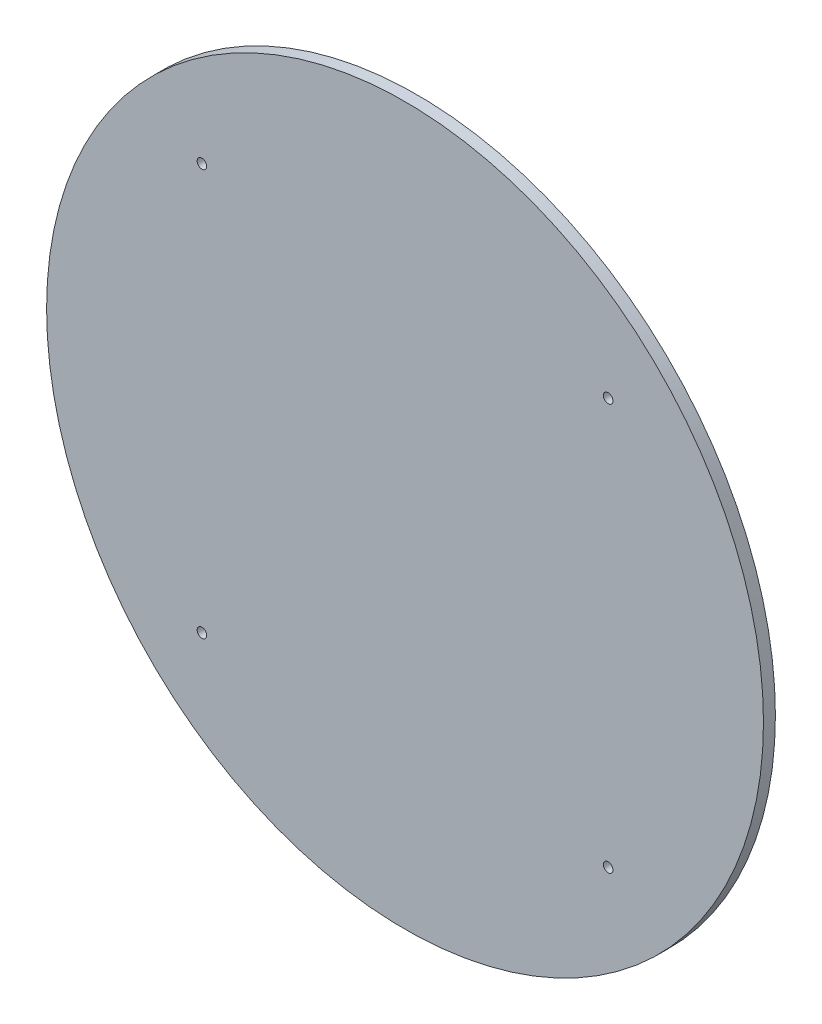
ISO-10303-21;
HEADER;
FILE_DESCRIPTION(('STEP AP214'),'2;1');
FILE_NAME('part.step','',(''),(''),'','','');
FILE_SCHEMA(('AUTOMOTIVE_DESIGN { 1 0 10303 214 1 1 1 1 }'));
ENDSEC;
DATA;
#1=APPLICATION_CONTEXT('core data for automotive mechanical design processes');
#2=APPLICATION_PROTOCOL_DEFINITION('international standard','automotive_design',2000,#1);
#3=PRODUCT_CONTEXT('',#1,'mechanical');
#4=PRODUCT('Part','Part','',(#3));
#5=PRODUCT_RELATED_PRODUCT_CATEGORY('part','',(#4));
#6=PRODUCT_DEFINITION_FORMATION('','',#4);
#7=PRODUCT_DEFINITION_CONTEXT('part definition',#1,'design');
#8=PRODUCT_DEFINITION('design','',#6,#7);
#9=PRODUCT_DEFINITION_SHAPE('','',#8);
#10=(LENGTH_UNIT() NAMED_UNIT(*) SI_UNIT(.MILLI.,.METRE.));
#11=(NAMED_UNIT(*) PLANE_ANGLE_UNIT() SI_UNIT($,.RADIAN.));
#12=(NAMED_UNIT(*) SI_UNIT($,.STERADIAN.) SOLID_ANGLE_UNIT());
#13=UNCERTAINTY_MEASURE_WITH_UNIT(LENGTH_MEASURE(1.E-05),#10,'distance_accuracy_value','');
#14=(GEOMETRIC_REPRESENTATION_CONTEXT(3) GLOBAL_UNCERTAINTY_ASSIGNED_CONTEXT((#13)) GLOBAL_UNIT_ASSIGNED_CONTEXT((#10,
#11,#12)) REPRESENTATION_CONTEXT('',''));
#15=CARTESIAN_POINT('',(0.,0.,0.));
#16=DIRECTION('',(0.,0.,1.));
#17=DIRECTION('',(1.,0.,0.));
#18=AXIS2_PLACEMENT_3D('',#15,#16,#17);
#19=CARTESIAN_POINT('',(0.,0.,5.));
#20=DIRECTION('',(0.,0.,-1.));
#21=DIRECTION('',(-1.,0.,0.));
#22=AXIS2_PLACEMENT_3D('',#19,#20,#21);
#23=CYLINDRICAL_SURFACE('',#22,150.);
#24=CARTESIAN_POINT('',(0.,0.,5.));
#25=DIRECTION('',(0.,0.,1.));
#26=DIRECTION('',(1.,0.,0.));
#27=AXIS2_PLACEMENT_3D('',#24,#25,#26);
#28=CIRCLE('',#27,150.);
#29=CARTESIAN_POINT('',(150.,0.,5.));
#30=VERTEX_POINT('',#29);
#31=EDGE_CURVE('E10',#30,#30,#28,.T.);
#32=ORIENTED_EDGE('',*,*,#31,.F.);
#33=EDGE_LOOP('',(#32));
#34=FACE_BOUND('',#33,.T.);
#35=CARTESIAN_POINT('',(0.,0.,0.));
#36=DIRECTION('',(0.,0.,1.));
#37=DIRECTION('',(1.,0.,0.));
#38=AXIS2_PLACEMENT_3D('',#35,#36,#37);
#39=CIRCLE('',#38,150.);
#40=CARTESIAN_POINT('',(150.,0.,0.));
#41=VERTEX_POINT('',#40);
#42=EDGE_CURVE('E34',#41,#41,#39,.T.);
#43=ORIENTED_EDGE('',*,*,#42,.T.);
#44=EDGE_LOOP('',(#43));
#45=FACE_BOUND('',#44,.T.);
#46=ADVANCED_FACE('F31',(#34,#45),#23,.T.);
#47=CARTESIAN_POINT('',(0.,0.,5.));
#48=DIRECTION('',(0.,0.,1.));
#49=DIRECTION('',(1.,0.,0.));
#50=AXIS2_PLACEMENT_3D('',#47,#48,#49);
#51=PLANE('',#50);
#52=CARTESIAN_POINT('',(85.,-85.,5.));
#53=DIRECTION('',(0.,0.,1.));
#54=DIRECTION('',(1.,0.,0.));
#55=AXIS2_PLACEMENT_3D('',#52,#53,#54);
#56=CIRCLE('',#55,2.);
#57=CARTESIAN_POINT('',(87.,-85.,5.));
#58=VERTEX_POINT('',#57);
#59=EDGE_CURVE('E63',#58,#58,#56,.T.);
#60=ORIENTED_EDGE('',*,*,#59,.F.);
#61=EDGE_LOOP('',(#60));
#62=FACE_BOUND('',#61,.T.);
#63=CARTESIAN_POINT('',(-85.,-85.,5.));
#64=DIRECTION('',(0.,0.,1.));
#65=DIRECTION('',(1.,0.,0.));
#66=AXIS2_PLACEMENT_3D('',#63,#64,#65);
#67=CIRCLE('',#66,2.);
#68=CARTESIAN_POINT('',(-83.,-85.,5.));
#69=VERTEX_POINT('',#68);
#70=EDGE_CURVE('E57',#69,#69,#67,.T.);
#71=ORIENTED_EDGE('',*,*,#70,.F.);
#72=EDGE_LOOP('',(#71));
#73=FACE_BOUND('',#72,.T.);
#74=CARTESIAN_POINT('',(85.,85.,5.));
#75=DIRECTION('',(0.,0.,1.));
#76=DIRECTION('',(1.,0.,0.));
#77=AXIS2_PLACEMENT_3D('',#74,#75,#76);
#78=CIRCLE('',#77,2.);
#79=CARTESIAN_POINT('',(87.,85.,5.));
#80=VERTEX_POINT('',#79);
#81=EDGE_CURVE('E51',#80,#80,#78,.T.);
#82=ORIENTED_EDGE('',*,*,#81,.F.);
#83=EDGE_LOOP('',(#82));
#84=FACE_BOUND('',#83,.T.);
#85=CARTESIAN_POINT('',(-85.,85.,5.));
#86=DIRECTION('',(0.,0.,1.));
#87=DIRECTION('',(1.,0.,0.));
#88=AXIS2_PLACEMENT_3D('',#85,#86,#87);
#89=CIRCLE('',#88,2.);
#90=CARTESIAN_POINT('',(-83.,85.,5.));
#91=VERTEX_POINT('',#90);
#92=EDGE_CURVE('E45',#91,#91,#89,.T.);
#93=ORIENTED_EDGE('',*,*,#92,.F.);
#94=EDGE_LOOP('',(#93));
#95=FACE_BOUND('',#94,.T.);
#96=ORIENTED_EDGE('',*,*,#31,.T.);
#97=EDGE_LOOP('',(#96));
#98=FACE_BOUND('',#97,.T.);
#99=ADVANCED_FACE('F69',(#62,#73,#84,#95,#98),#51,.T.);
#100=CARTESIAN_POINT('',(0.,0.,0.));
#101=DIRECTION('',(0.,0.,1.));
#102=DIRECTION('',(1.,0.,0.));
#103=AXIS2_PLACEMENT_3D('',#100,#101,#102);
#104=PLANE('',#103);
#105=CARTESIAN_POINT('',(85.,-85.,0.));
#106=DIRECTION('',(0.,0.,1.));
#107=DIRECTION('',(1.,0.,0.));
#108=AXIS2_PLACEMENT_3D('',#105,#106,#107);
#109=CIRCLE('',#108,2.);
#110=CARTESIAN_POINT('',(87.,-85.,0.));
#111=VERTEX_POINT('',#110);
#112=EDGE_CURVE('E60',#111,#111,#109,.T.);
#113=ORIENTED_EDGE('',*,*,#112,.T.);
#114=EDGE_LOOP('',(#113));
#115=FACE_BOUND('',#114,.T.);
#116=CARTESIAN_POINT('',(-85.,-85.,0.));
#117=DIRECTION('',(0.,0.,1.));
#118=DIRECTION('',(1.,0.,0.));
#119=AXIS2_PLACEMENT_3D('',#116,#117,#118);
#120=CIRCLE('',#119,2.);
#121=CARTESIAN_POINT('',(-83.,-85.,0.));
#122=VERTEX_POINT('',#121);
#123=EDGE_CURVE('E54',#122,#122,#120,.T.);
#124=ORIENTED_EDGE('',*,*,#123,.T.);
#125=EDGE_LOOP('',(#124));
#126=FACE_BOUND('',#125,.T.);
#127=CARTESIAN_POINT('',(85.,85.,0.));
#128=DIRECTION('',(0.,0.,1.));
#129=DIRECTION('',(1.,0.,0.));
#130=AXIS2_PLACEMENT_3D('',#127,#128,#129);
#131=CIRCLE('',#130,2.);
#132=CARTESIAN_POINT('',(87.,85.,0.));
#133=VERTEX_POINT('',#132);
#134=EDGE_CURVE('E48',#133,#133,#131,.T.);
#135=ORIENTED_EDGE('',*,*,#134,.T.);
#136=EDGE_LOOP('',(#135));
#137=FACE_BOUND('',#136,.T.);
#138=CARTESIAN_POINT('',(-85.,85.,0.));
#139=DIRECTION('',(0.,0.,1.));
#140=DIRECTION('',(1.,0.,0.));
#141=AXIS2_PLACEMENT_3D('',#138,#139,#140);
#142=CIRCLE('',#141,2.);
#143=CARTESIAN_POINT('',(-83.,85.,0.));
#144=VERTEX_POINT('',#143);
#145=EDGE_CURVE('E41',#144,#144,#142,.T.);
#146=ORIENTED_EDGE('',*,*,#145,.T.);
#147=EDGE_LOOP('',(#146));
#148=FACE_BOUND('',#147,.T.);
#149=ORIENTED_EDGE('',*,*,#42,.F.);
#150=EDGE_LOOP('',(#149));
#151=FACE_BOUND('',#150,.T.);
#152=ADVANCED_FACE('F72',(#115,#126,#137,#148,#151),#104,.F.);
#153=CARTESIAN_POINT('',(-85.,85.,5.));
#154=DIRECTION('',(0.,0.,1.));
#155=DIRECTION('',(1.,0.,0.));
#156=AXIS2_PLACEMENT_3D('',#153,#154,#155);
#157=CYLINDRICAL_SURFACE('',#156,2.);
#158=ORIENTED_EDGE('',*,*,#145,.F.);
#159=EDGE_LOOP('',(#158));
#160=FACE_BOUND('',#159,.T.);
#161=ORIENTED_EDGE('',*,*,#92,.T.);
#162=EDGE_LOOP('',(#161));
#163=FACE_BOUND('',#162,.T.);
#164=ADVANCED_FACE('F80',(#160,#163),#157,.F.);
#165=CARTESIAN_POINT('',(85.,85.,5.));
#166=DIRECTION('',(0.,0.,1.));
#167=DIRECTION('',(1.,0.,0.));
#168=AXIS2_PLACEMENT_3D('',#165,#166,#167);
#169=CYLINDRICAL_SURFACE('',#168,2.);
#170=ORIENTED_EDGE('',*,*,#134,.F.);
#171=EDGE_LOOP('',(#170));
#172=FACE_BOUND('',#171,.T.);
#173=ORIENTED_EDGE('',*,*,#81,.T.);
#174=EDGE_LOOP('',(#173));
#175=FACE_BOUND('',#174,.T.);
#176=ADVANCED_FACE('F82',(#172,#175),#169,.F.);
#177=CARTESIAN_POINT('',(-85.,-85.,5.));
#178=DIRECTION('',(0.,0.,1.));
#179=DIRECTION('',(1.,0.,0.));
#180=AXIS2_PLACEMENT_3D('',#177,#178,#179);
#181=CYLINDRICAL_SURFACE('',#180,2.);
#182=ORIENTED_EDGE('',*,*,#123,.F.);
#183=EDGE_LOOP('',(#182));
#184=FACE_BOUND('',#183,.T.);
#185=ORIENTED_EDGE('',*,*,#70,.T.);
#186=EDGE_LOOP('',(#185));
#187=FACE_BOUND('',#186,.T.);
#188=ADVANCED_FACE('F89',(#184,#187),#181,.F.);
#189=CARTESIAN_POINT('',(85.,-85.,5.));
#190=DIRECTION('',(0.,0.,1.));
#191=DIRECTION('',(1.,0.,0.));
#192=AXIS2_PLACEMENT_3D('',#189,#190,#191);
#193=CYLINDRICAL_SURFACE('',#192,2.);
#194=ORIENTED_EDGE('',*,*,#112,.F.);
#195=EDGE_LOOP('',(#194));
#196=FACE_BOUND('',#195,.T.);
#197=ORIENTED_EDGE('',*,*,#59,.T.);
#198=EDGE_LOOP('',(#197));
#199=FACE_BOUND('',#198,.T.);
#200=ADVANCED_FACE('F67',(#196,#199),#193,.F.);
#201=CLOSED_SHELL('',(#46,#99,#152,#164,#176,#188,#200));
#202=MANIFOLD_SOLID_BREP('B2',#201);
#203=ADVANCED_BREP_SHAPE_REPRESENTATION('',(#18,#202),#14);
#204=SHAPE_DEFINITION_REPRESENTATION(#9,#203);
ENDSEC;
END-ISO-10303-21;
